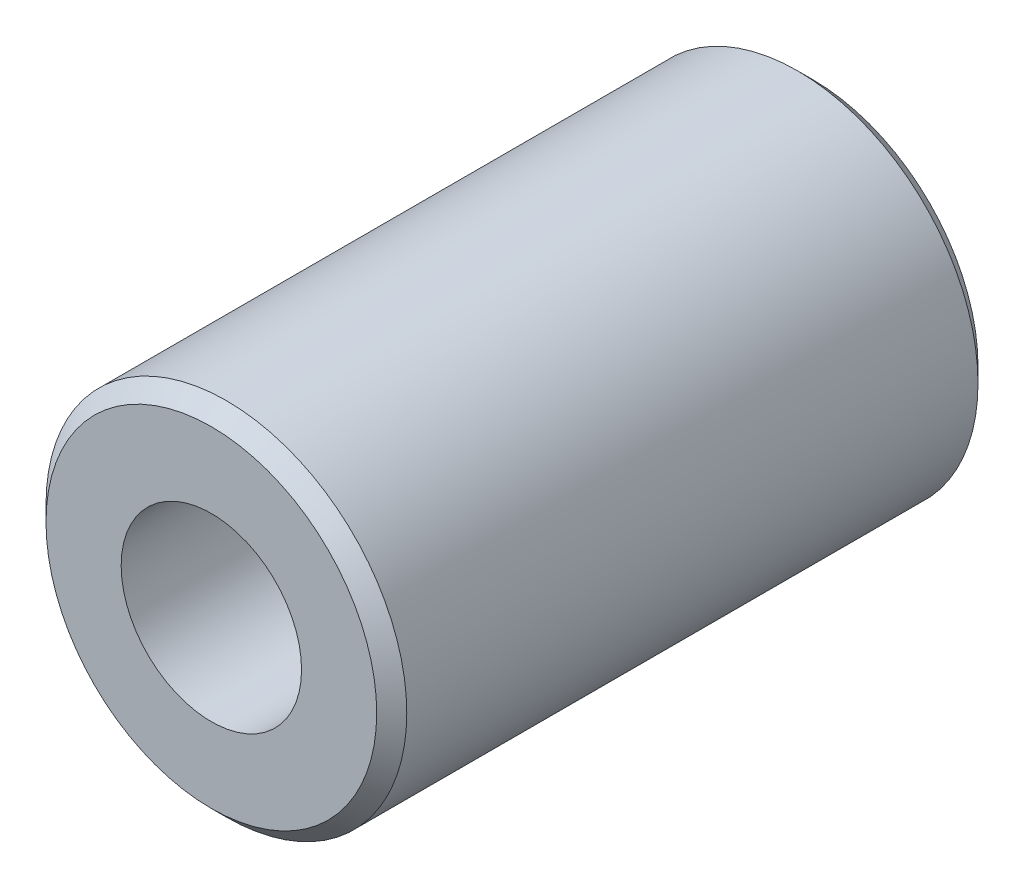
from build123d import *

# Parameters (mm, degrees)
ESQUISSE1_R        = 6
ESQUISSE1_R_2      = 3
BOSS_EXTRU_1_DEPTH = 10
CHANFREIN1_SIZE    = 0.5


with BuildPart() as part:
    # Esquisse1 → Boss.-Extru.1 (new, symmetric)
    with BuildSketch(Plane.XY):
        Circle(ESQUISSE1_R)
        Circle(ESQUISSE1_R_2, mode=Mode.SUBTRACT)
    extrude(amount=BOSS_EXTRU_1_DEPTH, both=True)

    # Chanfrein1
    chanfrein1_edges = [part.edges().sort_by_distance(p)[0] for p in [
        (-6, 0, -10),
        (-6, 0, 10),
    ]]
    chamfer(chanfrein1_edges, length=CHANFREIN1_SIZE)


solid = part.part
